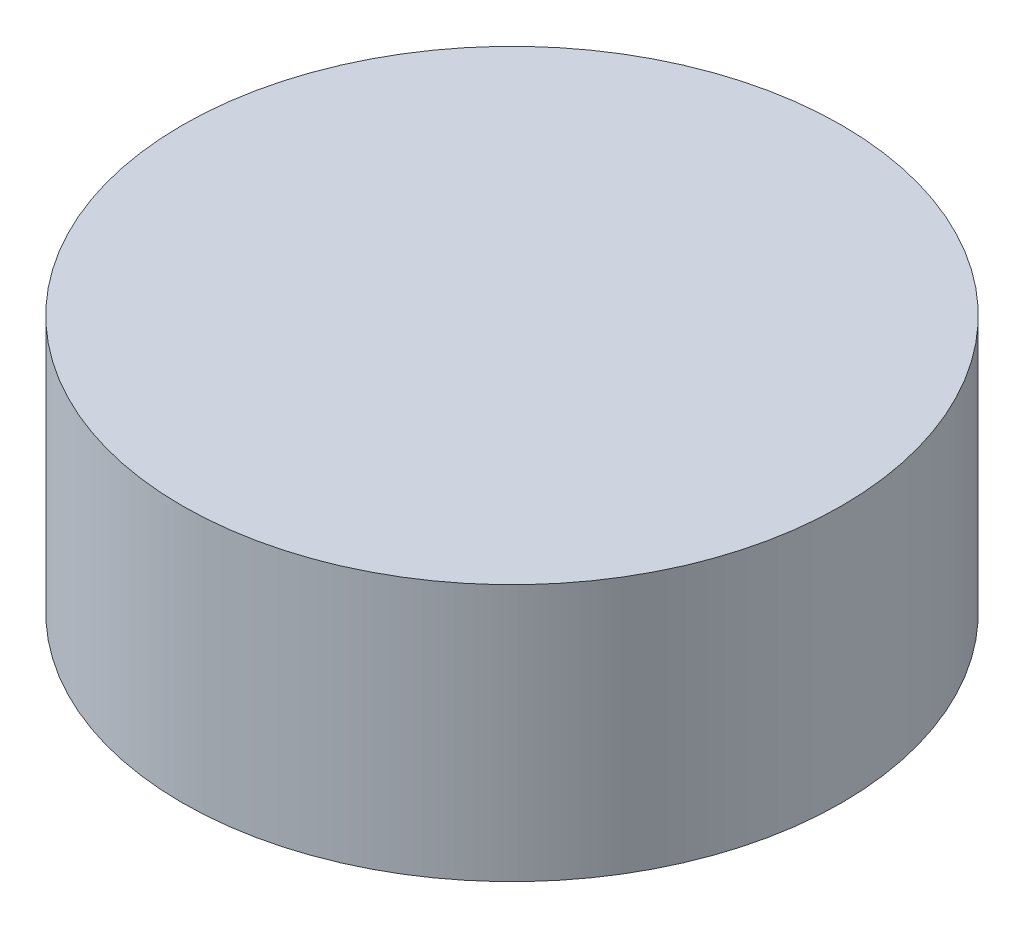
ISO-10303-21;
HEADER;
FILE_DESCRIPTION(('STEP AP214'),'2;1');
FILE_NAME('part.step','',(''),(''),'','','');
FILE_SCHEMA(('AUTOMOTIVE_DESIGN { 1 0 10303 214 1 1 1 1 }'));
ENDSEC;
DATA;
#1=APPLICATION_CONTEXT('core data for automotive mechanical design processes');
#2=APPLICATION_PROTOCOL_DEFINITION('international standard','automotive_design',2000,#1);
#3=PRODUCT_CONTEXT('',#1,'mechanical');
#4=PRODUCT('Part','Part','',(#3));
#5=PRODUCT_RELATED_PRODUCT_CATEGORY('part','',(#4));
#6=PRODUCT_DEFINITION_FORMATION('','',#4);
#7=PRODUCT_DEFINITION_CONTEXT('part definition',#1,'design');
#8=PRODUCT_DEFINITION('design','',#6,#7);
#9=PRODUCT_DEFINITION_SHAPE('','',#8);
#10=(LENGTH_UNIT() NAMED_UNIT(*) SI_UNIT(.MILLI.,.METRE.));
#11=(NAMED_UNIT(*) PLANE_ANGLE_UNIT() SI_UNIT($,.RADIAN.));
#12=(NAMED_UNIT(*) SI_UNIT($,.STERADIAN.) SOLID_ANGLE_UNIT());
#13=UNCERTAINTY_MEASURE_WITH_UNIT(LENGTH_MEASURE(1.E-05),#10,'distance_accuracy_value','');
#14=(GEOMETRIC_REPRESENTATION_CONTEXT(3) GLOBAL_UNCERTAINTY_ASSIGNED_CONTEXT((#13)) GLOBAL_UNIT_ASSIGNED_CONTEXT((#10,
#11,#12)) REPRESENTATION_CONTEXT('',''));
#15=CARTESIAN_POINT('',(0.,0.,0.));
#16=DIRECTION('',(0.,0.,1.));
#17=DIRECTION('',(1.,0.,0.));
#18=AXIS2_PLACEMENT_3D('',#15,#16,#17);
#19=CARTESIAN_POINT('',(0.,15.43,0.));
#20=DIRECTION('',(0.,-1.,0.));
#21=DIRECTION('',(0.,0.,-1.));
#22=AXIS2_PLACEMENT_3D('',#19,#20,#21);
#23=CYLINDRICAL_SURFACE('',#22,19.78);
#24=CARTESIAN_POINT('',(0.,15.43,0.));
#25=DIRECTION('',(0.,1.,0.));
#26=DIRECTION('',(0.,0.,1.));
#27=AXIS2_PLACEMENT_3D('',#24,#25,#26);
#28=CIRCLE('',#27,19.78);
#29=CARTESIAN_POINT('',(0.,15.43,19.78));
#30=VERTEX_POINT('',#29);
#31=EDGE_CURVE('E10',#30,#30,#28,.T.);
#32=ORIENTED_EDGE('',*,*,#31,.F.);
#33=EDGE_LOOP('',(#32));
#34=FACE_BOUND('',#33,.T.);
#35=CARTESIAN_POINT('',(0.,0.,0.));
#36=DIRECTION('',(0.,1.,0.));
#37=DIRECTION('',(0.,0.,1.));
#38=AXIS2_PLACEMENT_3D('',#35,#36,#37);
#39=CIRCLE('',#38,19.78);
#40=CARTESIAN_POINT('',(0.,0.,19.78));
#41=VERTEX_POINT('',#40);
#42=EDGE_CURVE('E46',#41,#41,#39,.T.);
#43=ORIENTED_EDGE('',*,*,#42,.T.);
#44=EDGE_LOOP('',(#43));
#45=FACE_BOUND('',#44,.T.);
#46=ADVANCED_FACE('F43',(#34,#45),#23,.T.);
#47=CARTESIAN_POINT('',(0.,15.43,0.));
#48=DIRECTION('',(0.,1.,0.));
#49=DIRECTION('',(0.,0.,1.));
#50=AXIS2_PLACEMENT_3D('',#47,#48,#49);
#51=PLANE('',#50);
#52=ORIENTED_EDGE('',*,*,#31,.T.);
#53=EDGE_LOOP('',(#52));
#54=FACE_BOUND('',#53,.T.);
#55=ADVANCED_FACE('F60',(#54),#51,.T.);
#56=CARTESIAN_POINT('',(0.,0.,0.));
#57=DIRECTION('',(0.,1.,0.));
#58=DIRECTION('',(0.,0.,1.));
#59=AXIS2_PLACEMENT_3D('',#56,#57,#58);
#60=PLANE('',#59);
#61=ORIENTED_EDGE('',*,*,#42,.F.);
#62=EDGE_LOOP('',(#61));
#63=FACE_BOUND('',#62,.T.);
#64=ADVANCED_FACE('F58',(#63),#60,.F.);
#65=CLOSED_SHELL('',(#46,#55,#64));
#66=MANIFOLD_SOLID_BREP('B2',#65);
#67=ADVANCED_BREP_SHAPE_REPRESENTATION('',(#18,#66),#14);
#68=SHAPE_DEFINITION_REPRESENTATION(#9,#67);
ENDSEC;
END-ISO-10303-21;
